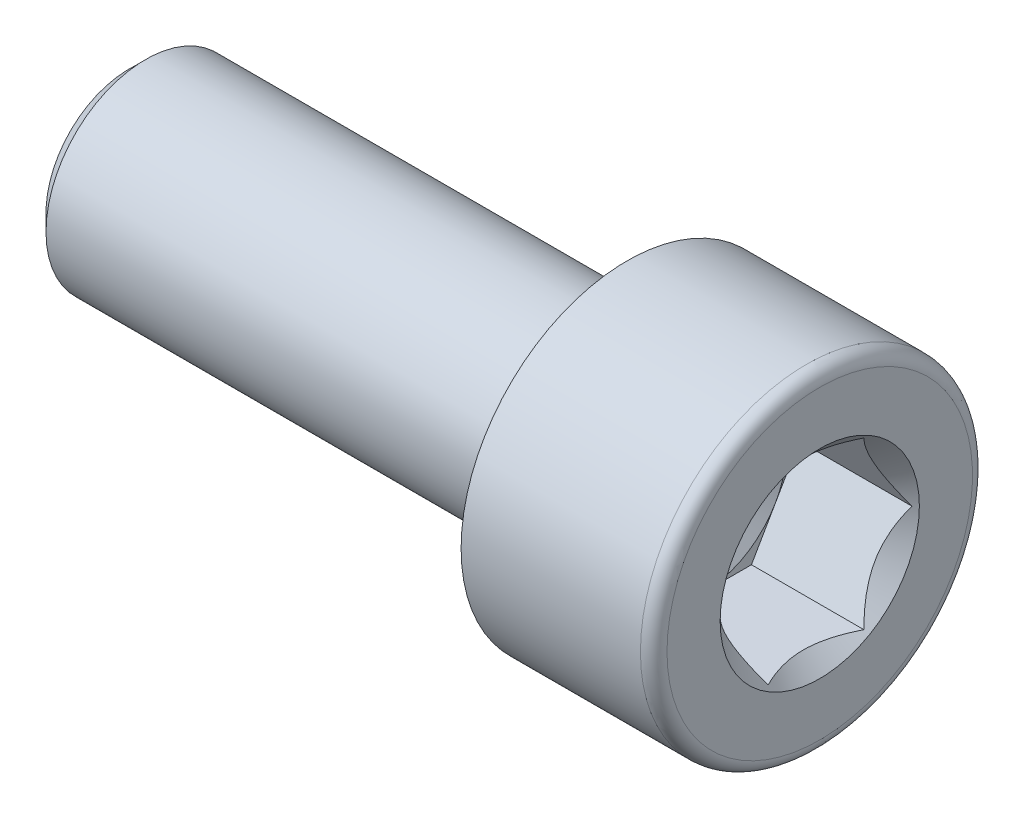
from build123d import *

# Parameters (mm, degrees)
CHANFREIN1_SIZE         = 0.5
ENL_V_MAT_EXTRU_1_DEPTH = 3.5


with BuildPart() as part:
    # Esquisse1 → Base-R_volution (revolve)
    with BuildSketch(Plane.XY, mode=Mode.PRIVATE) as base_r_volution_sk:
        with BuildLine():
            Line((0, 3), (0, 5))
            Line((0, 5), (5.4, 5))
            ThreePointArc((5.4, 5), (5.682842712, 4.882842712), (5.8, 4.6))
            Line((5.8, 4.6), (5.8, 3))
            Line((5.8, 3), (5.3, 2.5))
            Line((5.3, 2.5), (2.3, 2.5))
            Line((2.3, 2.5), (0.856624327, 0))
            Line((0.856624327, 0), (-15, 0))
            Line((-15, 0), (-15, 3))
            Line((-15, 3), (0, 3))
        make_face()
    revolve(base_r_volution_sk.sketch.rotate(Axis((-30, 0, 0), (1, 0, 0)), 90), axis=Axis((-30, 0, 0), (1, 0, 0)))

    # Chanfrein1
    chanfrein1_edges = [part.edges().sort_by_distance(p)[0] for p in [
        (-15, 0, -3),
    ]]
    chamfer(chanfrein1_edges, length=CHANFREIN1_SIZE)

    # Esquisse2 → Enl_v. mat.-Extru.1 (cut)
    with BuildSketch(Plane(origin=(5.8, 0, 0), x_dir=(0, 0, -1), z_dir=(1, 0, 0))):
        Polygon((-2.886751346, 0), (-1.443375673, -2.5), (1.443375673, -2.5), (2.886751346, 0), (1.443375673, 2.5), (-1.443375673, 2.5), align=None)
    extrude(amount=-ENL_V_MAT_EXTRU_1_DEPTH, mode=Mode.SUBTRACT)


solid = part.part
